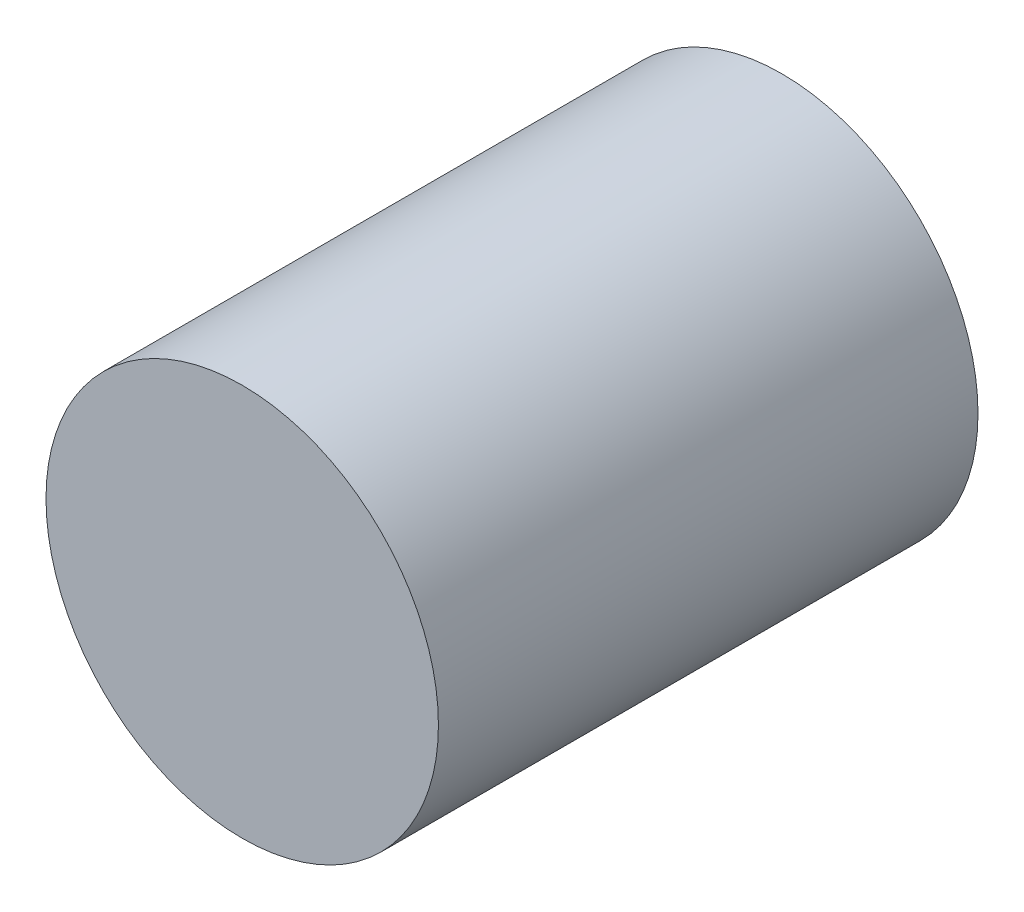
ISO-10303-21;
HEADER;
FILE_DESCRIPTION(('STEP AP214'),'2;1');
FILE_NAME('part.step','',(''),(''),'','','');
FILE_SCHEMA(('AUTOMOTIVE_DESIGN { 1 0 10303 214 1 1 1 1 }'));
ENDSEC;
DATA;
#1=APPLICATION_CONTEXT('core data for automotive mechanical design processes');
#2=APPLICATION_PROTOCOL_DEFINITION('international standard','automotive_design',2000,#1);
#3=PRODUCT_CONTEXT('',#1,'mechanical');
#4=PRODUCT('Part','Part','',(#3));
#5=PRODUCT_RELATED_PRODUCT_CATEGORY('part','',(#4));
#6=PRODUCT_DEFINITION_FORMATION('','',#4);
#7=PRODUCT_DEFINITION_CONTEXT('part definition',#1,'design');
#8=PRODUCT_DEFINITION('design','',#6,#7);
#9=PRODUCT_DEFINITION_SHAPE('','',#8);
#10=(LENGTH_UNIT() NAMED_UNIT(*) SI_UNIT(.MILLI.,.METRE.));
#11=(NAMED_UNIT(*) PLANE_ANGLE_UNIT() SI_UNIT($,.RADIAN.));
#12=(NAMED_UNIT(*) SI_UNIT($,.STERADIAN.) SOLID_ANGLE_UNIT());
#13=UNCERTAINTY_MEASURE_WITH_UNIT(LENGTH_MEASURE(1.E-05),#10,'distance_accuracy_value','');
#14=(GEOMETRIC_REPRESENTATION_CONTEXT(3) GLOBAL_UNCERTAINTY_ASSIGNED_CONTEXT((#13)) GLOBAL_UNIT_ASSIGNED_CONTEXT((#10,
#11,#12)) REPRESENTATION_CONTEXT('',''));
#15=CARTESIAN_POINT('',(0.,0.,0.));
#16=DIRECTION('',(0.,0.,1.));
#17=DIRECTION('',(1.,0.,0.));
#18=AXIS2_PLACEMENT_3D('',#15,#16,#17);
#19=CARTESIAN_POINT('',(0.,0.,11.));
#20=DIRECTION('',(0.,0.,-1.));
#21=DIRECTION('',(-1.,0.,0.));
#22=AXIS2_PLACEMENT_3D('',#19,#20,#21);
#23=CYLINDRICAL_SURFACE('',#22,4.);
#24=CARTESIAN_POINT('',(0.,0.,11.));
#25=DIRECTION('',(0.,0.,1.));
#26=DIRECTION('',(1.,0.,0.));
#27=AXIS2_PLACEMENT_3D('',#24,#25,#26);
#28=CIRCLE('',#27,4.);
#29=CARTESIAN_POINT('',(4.,0.,11.));
#30=VERTEX_POINT('',#29);
#31=EDGE_CURVE('E10',#30,#30,#28,.T.);
#32=ORIENTED_EDGE('',*,*,#31,.F.);
#33=EDGE_LOOP('',(#32));
#34=FACE_BOUND('',#33,.T.);
#35=CARTESIAN_POINT('',(0.,0.,0.));
#36=DIRECTION('',(0.,0.,1.));
#37=DIRECTION('',(1.,0.,0.));
#38=AXIS2_PLACEMENT_3D('',#35,#36,#37);
#39=CIRCLE('',#38,4.);
#40=CARTESIAN_POINT('',(4.,0.,0.));
#41=VERTEX_POINT('',#40);
#42=EDGE_CURVE('E40',#41,#41,#39,.T.);
#43=ORIENTED_EDGE('',*,*,#42,.T.);
#44=EDGE_LOOP('',(#43));
#45=FACE_BOUND('',#44,.T.);
#46=ADVANCED_FACE('F37',(#34,#45),#23,.T.);
#47=CARTESIAN_POINT('',(0.,0.,11.));
#48=DIRECTION('',(0.,0.,1.));
#49=DIRECTION('',(1.,0.,0.));
#50=AXIS2_PLACEMENT_3D('',#47,#48,#49);
#51=PLANE('',#50);
#52=ORIENTED_EDGE('',*,*,#31,.T.);
#53=EDGE_LOOP('',(#52));
#54=FACE_BOUND('',#53,.T.);
#55=ADVANCED_FACE('F54',(#54),#51,.T.);
#56=CARTESIAN_POINT('',(0.,0.,0.));
#57=DIRECTION('',(0.,0.,1.));
#58=DIRECTION('',(1.,0.,0.));
#59=AXIS2_PLACEMENT_3D('',#56,#57,#58);
#60=PLANE('',#59);
#61=ORIENTED_EDGE('',*,*,#42,.F.);
#62=EDGE_LOOP('',(#61));
#63=FACE_BOUND('',#62,.T.);
#64=ADVANCED_FACE('F52',(#63),#60,.F.);
#65=CLOSED_SHELL('',(#46,#55,#64));
#66=MANIFOLD_SOLID_BREP('B2',#65);
#67=ADVANCED_BREP_SHAPE_REPRESENTATION('',(#18,#66),#14);
#68=SHAPE_DEFINITION_REPRESENTATION(#9,#67);
ENDSEC;
END-ISO-10303-21;
